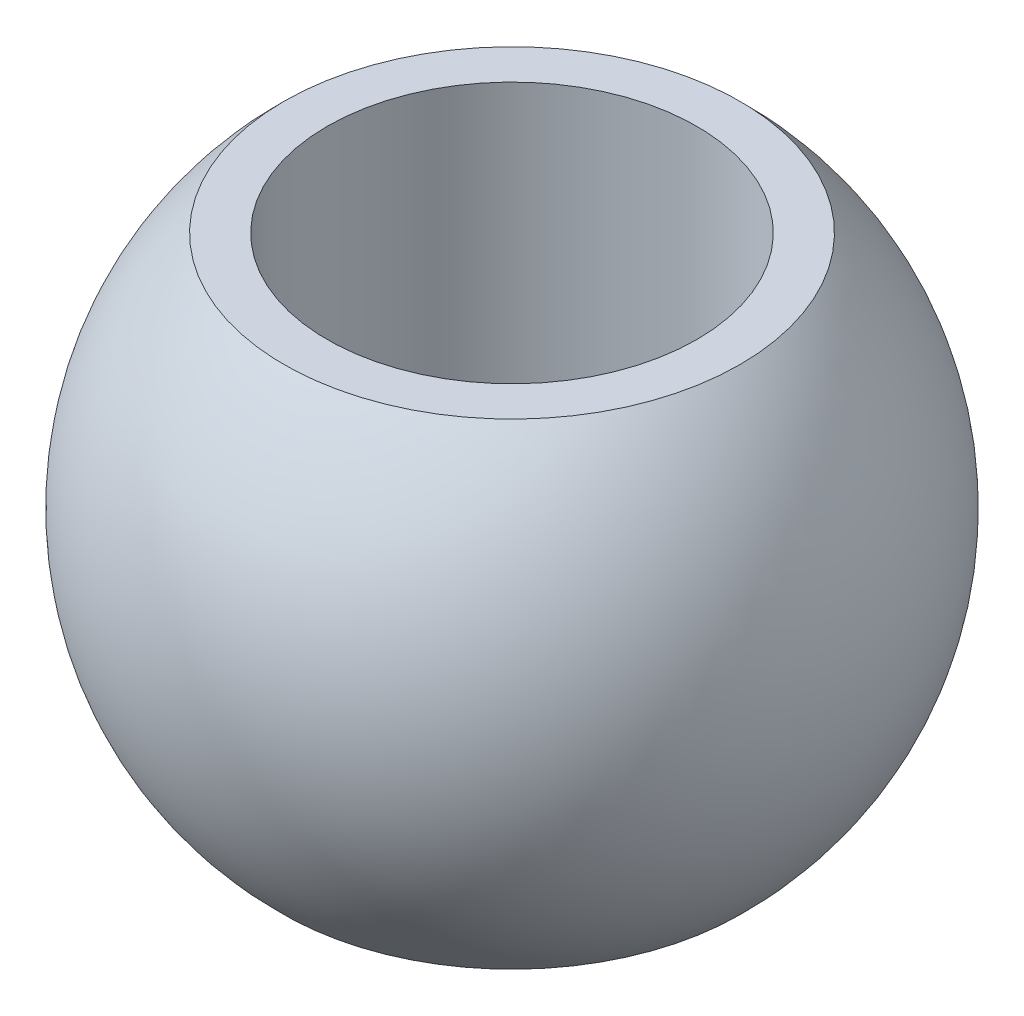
from build123d import *

# Parameters (mm, degrees)
ESQUISSE2_OUTSIDE_W     = 33.236
ESQUISSE2_OUTSIDE_H     = 33.236
ESQUISSE2_OUTSIDE_W_2   = 25.981705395
ESQUISSE2_OUTSIDE_H_2   = 16.76
ENL_V_MAT_EXTRU_1_DEPTH = 15
ESQUISSE3_R             = 6.5
ENL_V_MAT_EXTRU_2_DEPTH = 24.452454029


with BuildPart() as part:
    # Esquisse1 → Base-R_volution (revolve)
    with BuildSketch(Plane.XY):
        with BuildLine():
            Line((11.6, 0), (-11.6, 0))
            ThreePointArc((-11.6, 0), (0, 11.6), (11.6, 0))
        make_face()
    revolve(axis=Axis((20, 0, 0), (-1, 0, 0)))

    # Esquisse2 outside → Enl_v. mat.-Extru.1 (cut, symmetric)
    with BuildSketch(Plane.XY):
        Rectangle(ESQUISSE2_OUTSIDE_W, ESQUISSE2_OUTSIDE_H)
        with Locations((-0.08204749, 0)):
            Rectangle(ESQUISSE2_OUTSIDE_W_2, ESQUISSE2_OUTSIDE_H_2, mode=Mode.SUBTRACT)
    extrude(amount=ENL_V_MAT_EXTRU_1_DEPTH, both=True, mode=Mode.SUBTRACT)

    # Esquisse3 → Enl_v. mat.-Extru.2 (cut, through all)
    with BuildSketch(Plane(origin=(0, 8.38, 0), x_dir=(-1, 0, 0), z_dir=(0, 1, 0))):
        Circle(ESQUISSE3_R)
    extrude(amount=-ENL_V_MAT_EXTRU_2_DEPTH, mode=Mode.SUBTRACT)


solid = part.part
